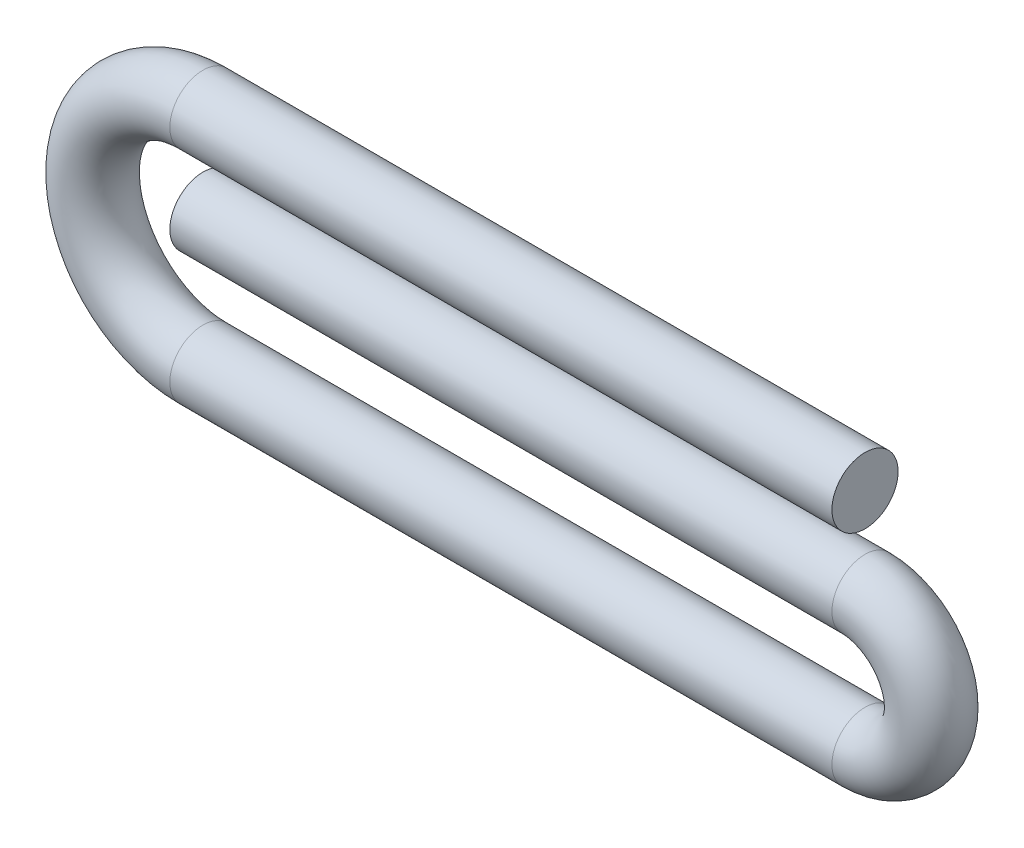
from build123d import *

# Parameters (mm, degrees)
SKETCH2_R = 1.5


with BuildPart() as part:
    # Sweep1: sweep along a path in Sketch1
    with BuildLine(Plane.XY) as sweep1_path:
        Line((0, 0), (30, 0))
        ThreePointArc((30, 0), (33, -3), (30, -6))
        Line((30, -6), (0, -6))
        ThreePointArc((0, -6), (-5, -1), (0, 4))
        Line((0, 4), (30, 4))
    # Sketch2 → Sweep1 (sweep)
    with BuildSketch(Plane(origin=(0, 0, 0), x_dir=(0, 0, -1), z_dir=(1, 0, 0))):
        Circle(SKETCH2_R)
    sweep(path=sweep1_path.line)


solid = part.part
